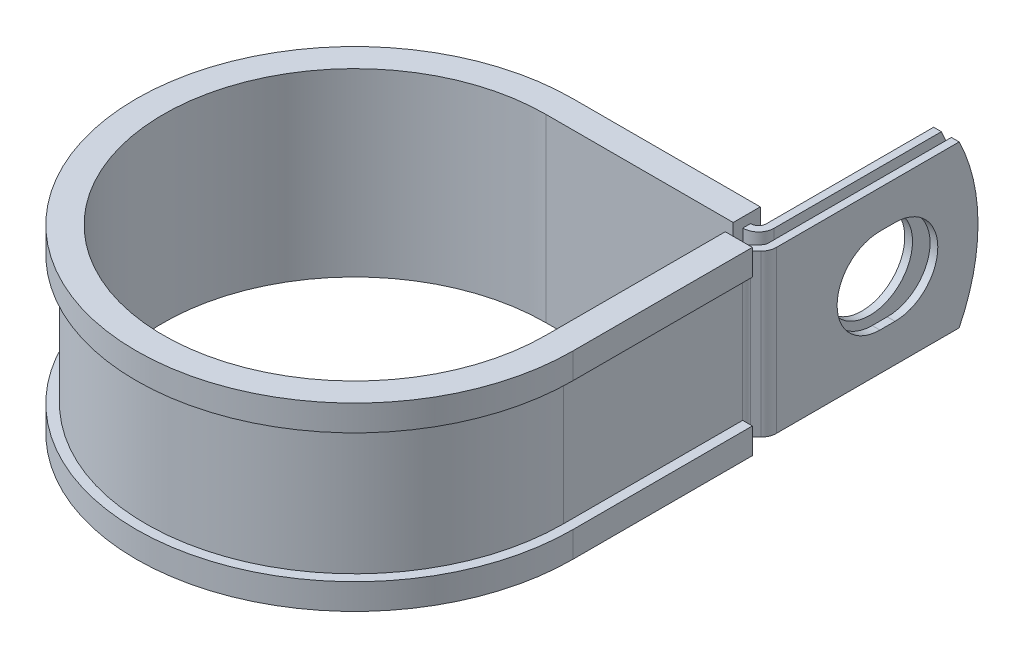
from build123d import *

# Parameters (mm, degrees)
EXTRUDE_THIN1_DEPTH = 12.7
SKETCH2_R           = 6.7437
CUT_EXTRUDE1_DEPTH  = 1.2192
CUT_EXTRUDE2_DEPTH  = 1.2192
CUT_EXTRUDE3_DEPTH  = 91.815489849


with BuildPart() as part:
    # Sketch1 → Extrude-Thin1 (new, symmetric)
    with BuildSketch(Plane(origin=(0, 0, 0), x_dir=(1, 0, 0), z_dir=(0, 1, 0))):
        with BuildLine():
            Line((33.5839698, 63.4746), (33.5839698, 31.6865))
            ThreePointArc((33.5839698, 31.6865), (33.491163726, 31.219932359), (33.226874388, 30.824395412))
            Line((33.226874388, 30.824395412), (32.400690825, 29.998211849))
            ThreePointArc((32.400690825, 29.998211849), (31.872112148, 29.207137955), (31.6865, 28.274002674))
            Line((31.6865, 28.274002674), (31.6865, 0))
            ThreePointArc((31.6865, 0), (-22.405739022, -22.405739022), (0, 31.6865))
            Line((0, 31.6865), (29.5707698, 31.6865))
            ThreePointArc((29.5707698, 31.6865), (31.294978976, 32.400690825), (32.0091698, 34.1249))
            Line((32.0091698, 34.1249), (32.0091698, 63.4746))
            Line((32.0091698, 63.4746), (30.7899698, 63.4746))
            Line((30.7899698, 63.4746), (30.7899698, 34.1249))
            ThreePointArc((30.7899698, 34.1249), (30.432874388, 33.262795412), (29.5707698, 32.9057))
            Line((29.5707698, 32.9057), (0, 32.9057))
            ThreePointArc((0, 32.9057), (-23.26784361, -23.26784361), (32.9057, 0))
            Line((32.9057, 0), (32.9057, 28.274002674))
            ThreePointArc((32.9057, 28.274002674), (32.998506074, 28.740570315), (33.262795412, 29.136107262))
            Line((33.262795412, 29.136107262), (34.088978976, 29.962290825))
            ThreePointArc((34.088978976, 29.962290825), (34.617557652, 30.753364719), (34.8031698, 31.6865))
            Line((34.8031698, 31.6865), (34.8031698, 63.4746))
            Line((34.8031698, 63.4746), (33.5839698, 63.4746))
        make_face()
    extrude(amount=EXTRUDE_THIN1_DEPTH, both=True)

    # Sketch2 → Cut-Extrude1 (cut)
    with BuildSketch(Plane.ZY.offset(-30.7899698)):
        with Locations((-49.1998, 0)):
            Circle(SKETCH2_R)
    extrude(amount=-CUT_EXTRUDE1_DEPTH, mode=Mode.SUBTRACT)

    # Sketch3 → Cut-Extrude2 (cut)
    with BuildSketch(Plane(origin=(34.8031698, 0, 0), x_dir=(0, 0, -1), z_dir=(1, 0, 0))):
        with BuildLine():
            Line((48.006, 6.7437), (50.3936, 6.7437))
            ThreePointArc((50.3936, 6.7437), (57.1373, 0), (50.3936, -6.7437))
            Line((50.3936, -6.7437), (48.006, -6.7437))
            ThreePointArc((48.006, -6.7437), (41.2623, 0), (48.006, 6.7437))
        make_face()
    extrude(amount=-CUT_EXTRUDE2_DEPTH, mode=Mode.SUBTRACT)

    # Sketch4 → Cut-Extrude3 (cut, through all)
    with BuildSketch(Plane.ZY.offset(-30.7899698)):
        with BuildLine():
            Line((-60.497268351, 12.7), (-63.4746, 12.7))
            Line((-63.4746, 12.7), (-63.4746, -5.9e-08))
            ThreePointArc((-63.4746, -5.9e-08), (-62.720311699, 6.522164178), (-60.497268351, 12.7))
        make_face()
        with BuildLine():
            ThreePointArc((-60.497268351, -12.7), (-62.720311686, -6.522164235), (-63.4746, -5.9e-08))
            Line((-63.4746, -5.9e-08), (-63.4746, -12.7))
            Line((-63.4746, -12.7), (-60.497268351, -12.7))
        make_face()
    extrude(amount=-CUT_EXTRUDE3_DEPTH, mode=Mode.SUBTRACT)

    # Sweep1: sweep along a path in Sketch6
    with BuildLine(Plane(origin=(0, 12.7, 0), x_dir=(1, 0, 0), z_dir=(0, 1, 0))) as sweep1_path:
        Line((30.1625, 28.274002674), (30.1625, 0))
        ThreePointArc((30.1625, 0), (-21.328108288, -21.328108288), (0, 30.1625))
        Line((0, 30.1625), (29.5199698, 30.1625))
    # Sketch5 → Sweep1 (sweep)
    with BuildSketch(Plane(origin=(0, 0, -28.274002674), x_dir=(-1, 0, 0), z_dir=(0, 0, -1))):
        Polygon((-32.9057, 12.7), (-31.6865, 12.7), (-31.6865, -12.7), (-32.9057, -12.7), (-32.9057, -10.16), (-34.4297, -10.16), (-34.4297, -14.224), (-30.1625, -14.224), (-30.1625, 14.224), (-34.4297, 14.224), (-34.4297, 10.16), (-32.9057, 10.16), align=None)
    sweep(path=sweep1_path.line)


solid = part.part
